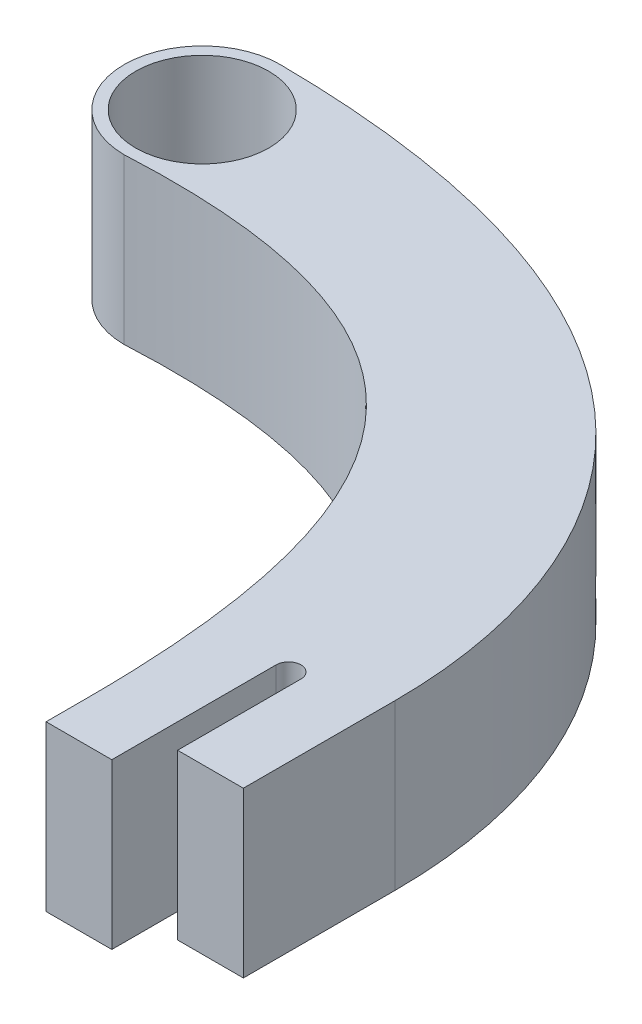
ISO-10303-21;
HEADER;
FILE_DESCRIPTION(('STEP AP214'),'2;1');
FILE_NAME('part.step','',(''),(''),'','','');
FILE_SCHEMA(('AUTOMOTIVE_DESIGN { 1 0 10303 214 1 1 1 1 }'));
ENDSEC;
DATA;
#1=APPLICATION_CONTEXT('core data for automotive mechanical design processes');
#2=APPLICATION_PROTOCOL_DEFINITION('international standard','automotive_design',2000,#1);
#3=PRODUCT_CONTEXT('',#1,'mechanical');
#4=PRODUCT('Part','Part','',(#3));
#5=PRODUCT_RELATED_PRODUCT_CATEGORY('part','',(#4));
#6=PRODUCT_DEFINITION_FORMATION('','',#4);
#7=PRODUCT_DEFINITION_CONTEXT('part definition',#1,'design');
#8=PRODUCT_DEFINITION('design','',#6,#7);
#9=PRODUCT_DEFINITION_SHAPE('','',#8);
#10=(LENGTH_UNIT() NAMED_UNIT(*) SI_UNIT(.MILLI.,.METRE.));
#11=(NAMED_UNIT(*) PLANE_ANGLE_UNIT() SI_UNIT($,.RADIAN.));
#12=(NAMED_UNIT(*) SI_UNIT($,.STERADIAN.) SOLID_ANGLE_UNIT());
#13=UNCERTAINTY_MEASURE_WITH_UNIT(LENGTH_MEASURE(1.E-05),#10,'distance_accuracy_value','');
#14=(GEOMETRIC_REPRESENTATION_CONTEXT(3) GLOBAL_UNCERTAINTY_ASSIGNED_CONTEXT((#13)) GLOBAL_UNIT_ASSIGNED_CONTEXT((#10,
#11,#12)) REPRESENTATION_CONTEXT('',''));
#15=CARTESIAN_POINT('',(0.,0.,0.));
#16=DIRECTION('',(0.,0.,1.));
#17=DIRECTION('',(1.,0.,0.));
#18=AXIS2_PLACEMENT_3D('',#15,#16,#17);
#19=CARTESIAN_POINT('',(0.,20.,0.));
#20=DIRECTION('',(0.,-1.,0.));
#21=DIRECTION('',(0.,0.,-1.));
#22=AXIS2_PLACEMENT_3D('',#19,#20,#21);
#23=CYLINDRICAL_SURFACE('',#22,8.1);
#24=CARTESIAN_POINT('',(0.,20.,0.));
#25=DIRECTION('',(0.,1.,0.));
#26=DIRECTION('',(0.,0.,1.));
#27=AXIS2_PLACEMENT_3D('',#24,#25,#26);
#28=CIRCLE('',#27,8.1);
#29=CARTESIAN_POINT('',(0.,20.,8.1));
#30=VERTEX_POINT('',#29);
#31=EDGE_CURVE('E152',#30,#30,#28,.T.);
#32=ORIENTED_EDGE('',*,*,#31,.T.);
#33=EDGE_LOOP('',(#32));
#34=FACE_BOUND('',#33,.T.);
#35=CARTESIAN_POINT('',(0.,1.99999999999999,0.));
#36=DIRECTION('',(0.,-1.,0.));
#37=DIRECTION('',(0.,0.,-1.));
#38=AXIS2_PLACEMENT_3D('',#35,#36,#37);
#39=CIRCLE('',#38,8.1);
#40=CARTESIAN_POINT('',(0.,1.99999999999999,-8.1));
#41=VERTEX_POINT('',#40);
#42=EDGE_CURVE('E351',#41,#41,#39,.T.);
#43=ORIENTED_EDGE('',*,*,#42,.T.);
#44=EDGE_LOOP('',(#43));
#45=FACE_BOUND('',#44,.T.);
#46=ADVANCED_FACE('F35',(#34,#45),#23,.F.);
#47=CARTESIAN_POINT('',(58.4816607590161,20.,10.5829400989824));
#48=DIRECTION('',(0.,-1.,0.));
#49=DIRECTION('',(0.,0.,-1.));
#50=AXIS2_PLACEMENT_3D('',#47,#48,#49);
#51=PLANE('',#50);
#52=CARTESIAN_POINT('',(74.0037175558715,20.,50.5402040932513));
#53=CARTESIAN_POINT('',(74.0037175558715,20.,23.6175330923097));
#54=CARTESIAN_POINT('',(57.2794719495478,20.,-9.07642752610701));
#55=CARTESIAN_POINT('',(-3.58339174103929E-13,20.,-9.50000000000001));
#56=B_SPLINE_CURVE_WITH_KNOTS('',3,(#52,#53,#54,#55),.UNSPECIFIED.,.F.,.F.,(4,4),(0.,1.),.UNSPECIFIED.);
#57=CARTESIAN_POINT('',(74.0037175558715,20.,50.5402040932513));
#58=VERTEX_POINT('',#57);
#59=CARTESIAN_POINT('',(0.,20.,-9.5));
#60=VERTEX_POINT('',#59);
#61=EDGE_CURVE('E175',#58,#60,#56,.T.);
#62=ORIENTED_EDGE('',*,*,#61,.T.);
#63=CARTESIAN_POINT('',(0.,20.,0.));
#64=DIRECTION('',(0.,1.,0.));
#65=DIRECTION('',(0.,0.,1.));
#66=AXIS2_PLACEMENT_3D('',#63,#64,#65);
#67=CIRCLE('',#66,9.5);
#68=CARTESIAN_POINT('',(0.,20.,9.5));
#69=VERTEX_POINT('',#68);
#70=EDGE_CURVE('E102',#60,#69,#67,.T.);
#71=ORIENTED_EDGE('',*,*,#70,.T.);
#72=CARTESIAN_POINT('',(0.,20.,9.5));
#73=CARTESIAN_POINT('',(39.0098476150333,20.,7.48813101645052));
#74=CARTESIAN_POINT('',(55.0000000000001,20.,25.5274489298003));
#75=CARTESIAN_POINT('',(55.,20.,69.0000000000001));
#76=B_SPLINE_CURVE_WITH_KNOTS('',3,(#72,#73,#74,#75),.UNSPECIFIED.,.F.,.F.,(4,4),(0.,1.),.UNSPECIFIED.);
#77=CARTESIAN_POINT('',(55.,20.,69.0000000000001));
#78=VERTEX_POINT('',#77);
#79=EDGE_CURVE('E196',#69,#78,#76,.T.);
#80=ORIENTED_EDGE('',*,*,#79,.T.);
#81=DIRECTION('',(0.,0.,1.));
#82=VECTOR('',#81,1.);
#83=CARTESIAN_POINT('',(55.,20.,69.));
#84=LINE('',#83,#82);
#85=CARTESIAN_POINT('',(55.,20.,74.));
#86=VERTEX_POINT('',#85);
#87=EDGE_CURVE('E214',#78,#86,#84,.T.);
#88=ORIENTED_EDGE('',*,*,#87,.T.);
#89=DIRECTION('',(1.,0.,0.));
#90=VECTOR('',#89,1.);
#91=CARTESIAN_POINT('',(55.,20.,74.));
#92=LINE('',#91,#90);
#93=CARTESIAN_POINT('',(63.,20.,74.));
#94=VERTEX_POINT('',#93);
#95=EDGE_CURVE('E211',#86,#94,#92,.T.);
#96=ORIENTED_EDGE('',*,*,#95,.T.);
#97=DIRECTION('',(0.,0.,-1.));
#98=VECTOR('',#97,1.);
#99=CARTESIAN_POINT('',(63.,20.,74.));
#100=LINE('',#99,#98);
#101=CARTESIAN_POINT('',(63.,20.,54.));
#102=VERTEX_POINT('',#101);
#103=EDGE_CURVE('E213',#94,#102,#100,.T.);
#104=ORIENTED_EDGE('',*,*,#103,.T.);
#105=CARTESIAN_POINT('',(64.5018587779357,20.,54.));
#106=DIRECTION('',(0.,-1.,0.));
#107=DIRECTION('',(0.,0.,-1.));
#108=AXIS2_PLACEMENT_3D('',#105,#106,#107);
#109=CIRCLE('',#108,1.50185877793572);
#110=CARTESIAN_POINT('',(66.0037175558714,20.,54.));
#111=VERTEX_POINT('',#110);
#112=EDGE_CURVE('E128',#102,#111,#109,.T.);
#113=ORIENTED_EDGE('',*,*,#112,.T.);
#114=DIRECTION('',(0.,0.,1.));
#115=VECTOR('',#114,1.);
#116=CARTESIAN_POINT('',(66.0037175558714,20.,54.));
#117=LINE('',#116,#115);
#118=CARTESIAN_POINT('',(66.0037175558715,20.,68.9993007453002));
#119=VERTEX_POINT('',#118);
#120=EDGE_CURVE('E121',#111,#119,#117,.T.);
#121=ORIENTED_EDGE('',*,*,#120,.T.);
#122=DIRECTION('',(1.,0.,0.));
#123=VECTOR('',#122,1.);
#124=CARTESIAN_POINT('',(66.0037175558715,20.,68.9993007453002));
#125=LINE('',#124,#123);
#126=CARTESIAN_POINT('',(74.0037175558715,20.,68.9993007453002));
#127=VERTEX_POINT('',#126);
#128=EDGE_CURVE('E126',#119,#127,#125,.T.);
#129=ORIENTED_EDGE('',*,*,#128,.T.);
#130=DIRECTION('',(0.,0.,-1.));
#131=VECTOR('',#130,1.);
#132=CARTESIAN_POINT('',(74.0037175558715,20.,68.9993007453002));
#133=LINE('',#132,#131);
#134=EDGE_CURVE('E53',#127,#58,#133,.T.);
#135=ORIENTED_EDGE('',*,*,#134,.T.);
#136=EDGE_LOOP('',(#62,#71,#80,#88,#96,#104,#113,#121,#129,#135));
#137=FACE_BOUND('',#136,.T.);
#138=ORIENTED_EDGE('',*,*,#31,.F.);
#139=EDGE_LOOP('',(#138));
#140=FACE_BOUND('',#139,.T.);
#141=ADVANCED_FACE('F123',(#137,#140),#51,.F.);
#142=CARTESIAN_POINT('',(58.4816607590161,0.,10.5829400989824));
#143=DIRECTION('',(0.,-1.,0.));
#144=DIRECTION('',(0.,0.,-1.));
#145=AXIS2_PLACEMENT_3D('',#142,#143,#144);
#146=PLANE('',#145);
#147=CARTESIAN_POINT('',(74.0037175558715,0.,50.5402040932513));
#148=CARTESIAN_POINT('',(74.0037175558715,0.,23.6175330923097));
#149=CARTESIAN_POINT('',(57.2794719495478,0.,-9.07642752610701));
#150=CARTESIAN_POINT('',(-3.58339174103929E-13,0.,-9.50000000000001));
#151=B_SPLINE_CURVE_WITH_KNOTS('',3,(#147,#148,#149,#150),.UNSPECIFIED.,.F.,.F.,(4,4),(0.,1.),.UNSPECIFIED.);
#152=CARTESIAN_POINT('',(74.0037175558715,0.,50.5402040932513));
#153=VERTEX_POINT('',#152);
#154=CARTESIAN_POINT('',(0.,0.,-9.5));
#155=VERTEX_POINT('',#154);
#156=EDGE_CURVE('E146',#153,#155,#151,.T.);
#157=ORIENTED_EDGE('',*,*,#156,.F.);
#158=DIRECTION('',(0.,0.,-1.));
#159=VECTOR('',#158,1.);
#160=CARTESIAN_POINT('',(74.0037175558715,0.,68.9993007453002));
#161=LINE('',#160,#159);
#162=CARTESIAN_POINT('',(74.0037175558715,0.,68.9993007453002));
#163=VERTEX_POINT('',#162);
#164=EDGE_CURVE('E94',#163,#153,#161,.T.);
#165=ORIENTED_EDGE('',*,*,#164,.F.);
#166=DIRECTION('',(1.,0.,0.));
#167=VECTOR('',#166,1.);
#168=CARTESIAN_POINT('',(66.0037175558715,0.,68.9993007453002));
#169=LINE('',#168,#167);
#170=CARTESIAN_POINT('',(66.0037175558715,0.,68.9993007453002));
#171=VERTEX_POINT('',#170);
#172=EDGE_CURVE('E88',#171,#163,#169,.T.);
#173=ORIENTED_EDGE('',*,*,#172,.F.);
#174=DIRECTION('',(0.,0.,1.));
#175=VECTOR('',#174,1.);
#176=CARTESIAN_POINT('',(66.0037175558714,0.,54.));
#177=LINE('',#176,#175);
#178=CARTESIAN_POINT('',(66.0037175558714,0.,54.));
#179=VERTEX_POINT('',#178);
#180=EDGE_CURVE('E136',#179,#171,#177,.T.);
#181=ORIENTED_EDGE('',*,*,#180,.F.);
#182=CARTESIAN_POINT('',(64.5018587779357,0.,54.));
#183=DIRECTION('',(0.,-1.,0.));
#184=DIRECTION('',(0.,0.,-1.));
#185=AXIS2_PLACEMENT_3D('',#182,#183,#184);
#186=CIRCLE('',#185,1.50185877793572);
#187=CARTESIAN_POINT('',(63.,0.,54.));
#188=VERTEX_POINT('',#187);
#189=EDGE_CURVE('E170',#188,#179,#186,.T.);
#190=ORIENTED_EDGE('',*,*,#189,.F.);
#191=DIRECTION('',(0.,0.,-1.));
#192=VECTOR('',#191,1.);
#193=CARTESIAN_POINT('',(63.,0.,74.));
#194=LINE('',#193,#192);
#195=CARTESIAN_POINT('',(63.,0.,74.));
#196=VERTEX_POINT('',#195);
#197=EDGE_CURVE('E168',#196,#188,#194,.T.);
#198=ORIENTED_EDGE('',*,*,#197,.F.);
#199=DIRECTION('',(1.,0.,0.));
#200=VECTOR('',#199,1.);
#201=CARTESIAN_POINT('',(55.,0.,74.));
#202=LINE('',#201,#200);
#203=CARTESIAN_POINT('',(55.,0.,74.));
#204=VERTEX_POINT('',#203);
#205=EDGE_CURVE('E166',#204,#196,#202,.T.);
#206=ORIENTED_EDGE('',*,*,#205,.F.);
#207=DIRECTION('',(0.,0.,1.));
#208=VECTOR('',#207,1.);
#209=CARTESIAN_POINT('',(55.,0.,69.));
#210=LINE('',#209,#208);
#211=CARTESIAN_POINT('',(55.,0.,69.0000000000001));
#212=VERTEX_POINT('',#211);
#213=EDGE_CURVE('E161',#212,#204,#210,.T.);
#214=ORIENTED_EDGE('',*,*,#213,.F.);
#215=CARTESIAN_POINT('',(0.,0.,9.5));
#216=CARTESIAN_POINT('',(39.0098476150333,0.,7.48813101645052));
#217=CARTESIAN_POINT('',(55.0000000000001,0.,25.5274489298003));
#218=CARTESIAN_POINT('',(55.,0.,69.0000000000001));
#219=B_SPLINE_CURVE_WITH_KNOTS('',3,(#215,#216,#217,#218),.UNSPECIFIED.,.F.,.F.,(4,4),(0.,1.),.UNSPECIFIED.);
#220=CARTESIAN_POINT('',(0.,0.,9.5));
#221=VERTEX_POINT('',#220);
#222=EDGE_CURVE('E157',#221,#212,#219,.T.);
#223=ORIENTED_EDGE('',*,*,#222,.F.);
#224=CARTESIAN_POINT('',(0.,0.,0.));
#225=DIRECTION('',(0.,1.,0.));
#226=DIRECTION('',(0.,0.,1.));
#227=AXIS2_PLACEMENT_3D('',#224,#225,#226);
#228=CIRCLE('',#227,9.5);
#229=EDGE_CURVE('E151',#155,#221,#228,.T.);
#230=ORIENTED_EDGE('',*,*,#229,.F.);
#231=EDGE_LOOP('',(#157,#165,#173,#181,#190,#198,#206,#214,#223,#230));
#232=FACE_BOUND('',#231,.T.);
#233=ADVANCED_FACE('F200',(#232),#146,.T.);
#234=DIRECTION('',(0.,-1.,0.));
#235=VECTOR('',#234,1.);
#236=SURFACE_OF_LINEAR_EXTRUSION('',#56,#235);
#237=ORIENTED_EDGE('',*,*,#156,.T.);
#238=DIRECTION('',(0.,-1.,0.));
#239=VECTOR('',#238,1.);
#240=CARTESIAN_POINT('',(0.,20.,-9.5));
#241=LINE('',#240,#239);
#242=EDGE_CURVE('E11',#60,#155,#241,.T.);
#243=ORIENTED_EDGE('',*,*,#242,.F.);
#244=ORIENTED_EDGE('',*,*,#61,.F.);
#245=DIRECTION('',(0.,-1.,0.));
#246=VECTOR('',#245,1.);
#247=CARTESIAN_POINT('',(74.0037175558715,20.,50.5402040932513));
#248=LINE('',#247,#246);
#249=EDGE_CURVE('E142',#58,#153,#248,.T.);
#250=ORIENTED_EDGE('',*,*,#249,.T.);
#251=EDGE_LOOP('',(#237,#243,#244,#250));
#252=FACE_BOUND('',#251,.T.);
#253=ADVANCED_FACE('F37',(#252),#236,.F.);
#254=CARTESIAN_POINT('',(0.,20.,0.));
#255=DIRECTION('',(0.,-1.,0.));
#256=DIRECTION('',(0.,0.,-1.));
#257=AXIS2_PLACEMENT_3D('',#254,#255,#256);
#258=CYLINDRICAL_SURFACE('',#257,9.5);
#259=ORIENTED_EDGE('',*,*,#229,.T.);
#260=DIRECTION('',(0.,-1.,0.));
#261=VECTOR('',#260,1.);
#262=CARTESIAN_POINT('',(0.,20.,9.5));
#263=LINE('',#262,#261);
#264=EDGE_CURVE('E45',#69,#221,#263,.T.);
#265=ORIENTED_EDGE('',*,*,#264,.F.);
#266=ORIENTED_EDGE('',*,*,#70,.F.);
#267=ORIENTED_EDGE('',*,*,#242,.T.);
#268=EDGE_LOOP('',(#259,#265,#266,#267));
#269=FACE_BOUND('',#268,.T.);
#270=ADVANCED_FACE('F229',(#269),#258,.T.);
#271=DIRECTION('',(0.,-1.,0.));
#272=VECTOR('',#271,1.);
#273=SURFACE_OF_LINEAR_EXTRUSION('',#76,#272);
#274=ORIENTED_EDGE('',*,*,#222,.T.);
#275=DIRECTION('',(0.,-1.,0.));
#276=VECTOR('',#275,1.);
#277=CARTESIAN_POINT('',(55.,20.,69.0000000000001));
#278=LINE('',#277,#276);
#279=EDGE_CURVE('E188',#78,#212,#278,.T.);
#280=ORIENTED_EDGE('',*,*,#279,.F.);
#281=ORIENTED_EDGE('',*,*,#79,.F.);
#282=ORIENTED_EDGE('',*,*,#264,.T.);
#283=EDGE_LOOP('',(#274,#280,#281,#282));
#284=FACE_BOUND('',#283,.T.);
#285=ADVANCED_FACE('F194',(#284),#273,.F.);
#286=CARTESIAN_POINT('',(55.,20.,69.));
#287=DIRECTION('',(1.,0.,0.));
#288=DIRECTION('',(0.,0.,-1.));
#289=AXIS2_PLACEMENT_3D('',#286,#287,#288);
#290=PLANE('',#289);
#291=ORIENTED_EDGE('',*,*,#213,.T.);
#292=DIRECTION('',(0.,-1.,0.));
#293=VECTOR('',#292,1.);
#294=CARTESIAN_POINT('',(55.,20.,74.));
#295=LINE('',#294,#293);
#296=EDGE_CURVE('E185',#86,#204,#295,.T.);
#297=ORIENTED_EDGE('',*,*,#296,.F.);
#298=ORIENTED_EDGE('',*,*,#87,.F.);
#299=ORIENTED_EDGE('',*,*,#279,.T.);
#300=EDGE_LOOP('',(#291,#297,#298,#299));
#301=FACE_BOUND('',#300,.T.);
#302=ADVANCED_FACE('F205',(#301),#290,.F.);
#303=CARTESIAN_POINT('',(55.,20.,74.));
#304=DIRECTION('',(0.,0.,-1.));
#305=DIRECTION('',(-1.,0.,0.));
#306=AXIS2_PLACEMENT_3D('',#303,#304,#305);
#307=PLANE('',#306);
#308=ORIENTED_EDGE('',*,*,#205,.T.);
#309=DIRECTION('',(0.,-1.,0.));
#310=VECTOR('',#309,1.);
#311=CARTESIAN_POINT('',(63.,20.,74.));
#312=LINE('',#311,#310);
#313=EDGE_CURVE('E182',#94,#196,#312,.T.);
#314=ORIENTED_EDGE('',*,*,#313,.F.);
#315=ORIENTED_EDGE('',*,*,#95,.F.);
#316=ORIENTED_EDGE('',*,*,#296,.T.);
#317=EDGE_LOOP('',(#308,#314,#315,#316));
#318=FACE_BOUND('',#317,.T.);
#319=ADVANCED_FACE('F209',(#318),#307,.F.);
#320=CARTESIAN_POINT('',(63.,20.,74.));
#321=DIRECTION('',(-1.,0.,0.));
#322=DIRECTION('',(0.,0.,1.));
#323=AXIS2_PLACEMENT_3D('',#320,#321,#322);
#324=PLANE('',#323);
#325=ORIENTED_EDGE('',*,*,#197,.T.);
#326=DIRECTION('',(0.,-1.,0.));
#327=VECTOR('',#326,1.);
#328=CARTESIAN_POINT('',(63.,20.,54.));
#329=LINE('',#328,#327);
#330=EDGE_CURVE('E179',#102,#188,#329,.T.);
#331=ORIENTED_EDGE('',*,*,#330,.F.);
#332=ORIENTED_EDGE('',*,*,#103,.F.);
#333=ORIENTED_EDGE('',*,*,#313,.T.);
#334=EDGE_LOOP('',(#325,#331,#332,#333));
#335=FACE_BOUND('',#334,.T.);
#336=ADVANCED_FACE('F260',(#335),#324,.F.);
#337=CARTESIAN_POINT('',(64.5018587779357,20.,54.));
#338=DIRECTION('',(0.,-1.,0.));
#339=DIRECTION('',(0.,0.,-1.));
#340=AXIS2_PLACEMENT_3D('',#337,#338,#339);
#341=CYLINDRICAL_SURFACE('',#340,1.50185877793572);
#342=ORIENTED_EDGE('',*,*,#189,.T.);
#343=DIRECTION('',(0.,-1.,0.));
#344=VECTOR('',#343,1.);
#345=CARTESIAN_POINT('',(66.0037175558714,20.,54.));
#346=LINE('',#345,#344);
#347=EDGE_CURVE('E137',#111,#179,#346,.T.);
#348=ORIENTED_EDGE('',*,*,#347,.F.);
#349=ORIENTED_EDGE('',*,*,#112,.F.);
#350=ORIENTED_EDGE('',*,*,#330,.T.);
#351=EDGE_LOOP('',(#342,#348,#349,#350));
#352=FACE_BOUND('',#351,.T.);
#353=ADVANCED_FACE('F257',(#352),#341,.F.);
#354=CARTESIAN_POINT('',(66.0037175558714,20.,54.));
#355=DIRECTION('',(1.,0.,0.));
#356=DIRECTION('',(0.,0.,-1.));
#357=AXIS2_PLACEMENT_3D('',#354,#355,#356);
#358=PLANE('',#357);
#359=ORIENTED_EDGE('',*,*,#180,.T.);
#360=DIRECTION('',(0.,-1.,0.));
#361=VECTOR('',#360,1.);
#362=CARTESIAN_POINT('',(66.0037175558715,20.,68.9993007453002));
#363=LINE('',#362,#361);
#364=EDGE_CURVE('E133',#119,#171,#363,.T.);
#365=ORIENTED_EDGE('',*,*,#364,.F.);
#366=ORIENTED_EDGE('',*,*,#120,.F.);
#367=ORIENTED_EDGE('',*,*,#347,.T.);
#368=EDGE_LOOP('',(#359,#365,#366,#367));
#369=FACE_BOUND('',#368,.T.);
#370=ADVANCED_FACE('F134',(#369),#358,.F.);
#371=CARTESIAN_POINT('',(66.0037175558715,20.,68.9993007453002));
#372=DIRECTION('',(0.,0.,-1.));
#373=DIRECTION('',(-1.,0.,0.));
#374=AXIS2_PLACEMENT_3D('',#371,#372,#373);
#375=PLANE('',#374);
#376=ORIENTED_EDGE('',*,*,#172,.T.);
#377=DIRECTION('',(0.,-1.,0.));
#378=VECTOR('',#377,1.);
#379=CARTESIAN_POINT('',(74.0037175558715,20.,68.9993007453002));
#380=LINE('',#379,#378);
#381=EDGE_CURVE('E138',#127,#163,#380,.T.);
#382=ORIENTED_EDGE('',*,*,#381,.F.);
#383=ORIENTED_EDGE('',*,*,#128,.F.);
#384=ORIENTED_EDGE('',*,*,#364,.T.);
#385=EDGE_LOOP('',(#376,#382,#383,#384));
#386=FACE_BOUND('',#385,.T.);
#387=ADVANCED_FACE('F140',(#386),#375,.F.);
#388=CARTESIAN_POINT('',(74.0037175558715,20.,68.9993007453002));
#389=DIRECTION('',(-1.,0.,0.));
#390=DIRECTION('',(0.,0.,1.));
#391=AXIS2_PLACEMENT_3D('',#388,#389,#390);
#392=PLANE('',#391);
#393=ORIENTED_EDGE('',*,*,#164,.T.);
#394=ORIENTED_EDGE('',*,*,#249,.F.);
#395=ORIENTED_EDGE('',*,*,#134,.F.);
#396=ORIENTED_EDGE('',*,*,#381,.T.);
#397=EDGE_LOOP('',(#393,#394,#395,#396));
#398=FACE_BOUND('',#397,.T.);
#399=ADVANCED_FACE('F250',(#398),#392,.F.);
#400=CARTESIAN_POINT('',(0.,1.99999999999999,0.));
#401=DIRECTION('',(0.,-1.,0.));
#402=DIRECTION('',(0.,0.,-1.));
#403=AXIS2_PLACEMENT_3D('',#400,#401,#402);
#404=PLANE('',#403);
#405=ORIENTED_EDGE('',*,*,#42,.F.);
#406=EDGE_LOOP('',(#405));
#407=FACE_BOUND('',#406,.T.);
#408=ADVANCED_FACE('F246',(#407),#404,.F.);
#409=CLOSED_SHELL('',(#46,#141,#233,#253,#270,#285,#302,#319,#336,#353,#370,#387,#399,#408));
#410=MANIFOLD_SOLID_BREP('B2',#409);
#411=ADVANCED_BREP_SHAPE_REPRESENTATION('',(#18,#410),#14);
#412=SHAPE_DEFINITION_REPRESENTATION(#9,#411);
ENDSEC;
END-ISO-10303-21;
